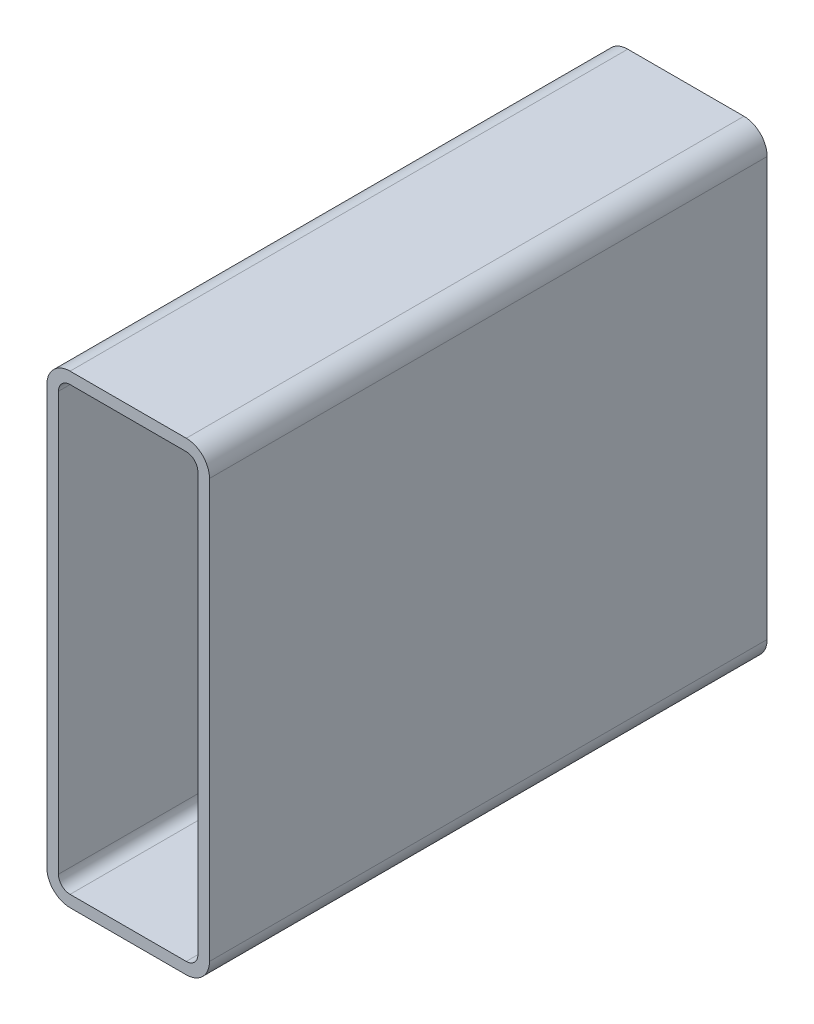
ISO-10303-21;
HEADER;
FILE_DESCRIPTION(('STEP AP214'),'2;1');
FILE_NAME('part.step','',(''),(''),'','','');
FILE_SCHEMA(('AUTOMOTIVE_DESIGN { 1 0 10303 214 1 1 1 1 }'));
ENDSEC;
DATA;
#1=APPLICATION_CONTEXT('core data for automotive mechanical design processes');
#2=APPLICATION_PROTOCOL_DEFINITION('international standard','automotive_design',2000,#1);
#3=PRODUCT_CONTEXT('',#1,'mechanical');
#4=PRODUCT('Part','Part','',(#3));
#5=PRODUCT_RELATED_PRODUCT_CATEGORY('part','',(#4));
#6=PRODUCT_DEFINITION_FORMATION('','',#4);
#7=PRODUCT_DEFINITION_CONTEXT('part definition',#1,'design');
#8=PRODUCT_DEFINITION('design','',#6,#7);
#9=PRODUCT_DEFINITION_SHAPE('','',#8);
#10=(LENGTH_UNIT() NAMED_UNIT(*) SI_UNIT(.MILLI.,.METRE.));
#11=(NAMED_UNIT(*) PLANE_ANGLE_UNIT() SI_UNIT($,.RADIAN.));
#12=(NAMED_UNIT(*) SI_UNIT($,.STERADIAN.) SOLID_ANGLE_UNIT());
#13=UNCERTAINTY_MEASURE_WITH_UNIT(LENGTH_MEASURE(1.E-05),#10,'distance_accuracy_value','');
#14=(GEOMETRIC_REPRESENTATION_CONTEXT(3) GLOBAL_UNCERTAINTY_ASSIGNED_CONTEXT((#13)) GLOBAL_UNIT_ASSIGNED_CONTEXT((#10,
#11,#12)) REPRESENTATION_CONTEXT('',''));
#15=CARTESIAN_POINT('',(0.,0.,0.));
#16=DIRECTION('',(0.,0.,1.));
#17=DIRECTION('',(1.,0.,0.));
#18=AXIS2_PLACEMENT_3D('',#15,#16,#17);
#19=CARTESIAN_POINT('',(14.7821469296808,243.220313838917,304.8));
#20=DIRECTION('',(0.,0.,1.));
#21=DIRECTION('',(1.,0.,0.));
#22=AXIS2_PLACEMENT_3D('',#19,#20,#21);
#23=PLANE('',#22);
#24=CARTESIAN_POINT('',(14.7821469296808,243.220313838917,304.8));
#25=DIRECTION('',(0.,0.,1.));
#26=DIRECTION('',(1.,0.,0.));
#27=AXIS2_PLACEMENT_3D('',#24,#25,#26);
#28=CIRCLE('',#27,12.7);
#29=CARTESIAN_POINT('',(14.7821469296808,255.920313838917,304.8));
#30=VERTEX_POINT('',#29);
#31=CARTESIAN_POINT('',(2.08214692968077,243.220313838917,304.8));
#32=VERTEX_POINT('',#31);
#33=EDGE_CURVE('E211',#30,#32,#28,.T.);
#34=ORIENTED_EDGE('',*,*,#33,.T.);
#35=DIRECTION('',(0.,-1.,0.));
#36=VECTOR('',#35,1.);
#37=CARTESIAN_POINT('',(2.08214692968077,14.6203138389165,304.8));
#38=LINE('',#37,#36);
#39=CARTESIAN_POINT('',(2.08214692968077,14.6203138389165,304.8));
#40=VERTEX_POINT('',#39);
#41=EDGE_CURVE('E214',#32,#40,#38,.T.);
#42=ORIENTED_EDGE('',*,*,#41,.T.);
#43=CARTESIAN_POINT('',(14.7821469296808,14.6203138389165,304.8));
#44=DIRECTION('',(0.,0.,1.));
#45=DIRECTION('',(1.,0.,0.));
#46=AXIS2_PLACEMENT_3D('',#43,#44,#45);
#47=CIRCLE('',#46,12.7);
#48=CARTESIAN_POINT('',(14.7821469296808,1.92031383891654,304.8));
#49=VERTEX_POINT('',#48);
#50=EDGE_CURVE('E217',#40,#49,#47,.T.);
#51=ORIENTED_EDGE('',*,*,#50,.T.);
#52=DIRECTION('',(1.,0.,0.));
#53=VECTOR('',#52,1.);
#54=CARTESIAN_POINT('',(78.2821469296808,1.92031383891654,304.8));
#55=LINE('',#54,#53);
#56=CARTESIAN_POINT('',(78.2821469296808,1.92031383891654,304.8));
#57=VERTEX_POINT('',#56);
#58=EDGE_CURVE('E219',#49,#57,#55,.T.);
#59=ORIENTED_EDGE('',*,*,#58,.T.);
#60=CARTESIAN_POINT('',(78.2821469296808,14.6203138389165,304.8));
#61=DIRECTION('',(0.,0.,1.));
#62=DIRECTION('',(1.,0.,0.));
#63=AXIS2_PLACEMENT_3D('',#60,#61,#62);
#64=CIRCLE('',#63,12.7);
#65=CARTESIAN_POINT('',(90.9821469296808,14.6203138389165,304.8));
#66=VERTEX_POINT('',#65);
#67=EDGE_CURVE('E221',#57,#66,#64,.T.);
#68=ORIENTED_EDGE('',*,*,#67,.T.);
#69=DIRECTION('',(0.,1.,0.));
#70=VECTOR('',#69,1.);
#71=CARTESIAN_POINT('',(90.9821469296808,243.220313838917,304.8));
#72=LINE('',#71,#70);
#73=CARTESIAN_POINT('',(90.9821469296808,243.220313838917,304.8));
#74=VERTEX_POINT('',#73);
#75=EDGE_CURVE('E223',#66,#74,#72,.T.);
#76=ORIENTED_EDGE('',*,*,#75,.T.);
#77=CARTESIAN_POINT('',(78.2821469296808,243.220313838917,304.8));
#78=DIRECTION('',(0.,0.,1.));
#79=DIRECTION('',(1.,0.,0.));
#80=AXIS2_PLACEMENT_3D('',#77,#78,#79);
#81=CIRCLE('',#80,12.7);
#82=CARTESIAN_POINT('',(78.2821469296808,255.920313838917,304.8));
#83=VERTEX_POINT('',#82);
#84=EDGE_CURVE('E225',#74,#83,#81,.T.);
#85=ORIENTED_EDGE('',*,*,#84,.T.);
#86=DIRECTION('',(-1.,0.,0.));
#87=VECTOR('',#86,1.);
#88=CARTESIAN_POINT('',(14.7821469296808,255.920313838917,304.8));
#89=LINE('',#88,#87);
#90=EDGE_CURVE('E227',#83,#30,#89,.T.);
#91=ORIENTED_EDGE('',*,*,#90,.T.);
#92=EDGE_LOOP('',(#34,#42,#51,#59,#68,#76,#85,#91));
#93=FACE_BOUND('',#92,.T.);
#94=DIRECTION('',(0.,-1.,0.));
#95=VECTOR('',#94,1.);
#96=CARTESIAN_POINT('',(8.43214692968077,14.6203138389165,304.8));
#97=LINE('',#96,#95);
#98=CARTESIAN_POINT('',(8.43214692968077,243.220313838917,304.8));
#99=VERTEX_POINT('',#98);
#100=CARTESIAN_POINT('',(8.43214692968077,14.6203138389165,304.8));
#101=VERTEX_POINT('',#100);
#102=EDGE_CURVE('E154',#99,#101,#97,.T.);
#103=ORIENTED_EDGE('',*,*,#102,.F.);
#104=CARTESIAN_POINT('',(14.7821469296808,243.220313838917,304.8));
#105=DIRECTION('',(0.,0.,1.));
#106=DIRECTION('',(1.,0.,0.));
#107=AXIS2_PLACEMENT_3D('',#104,#105,#106);
#108=CIRCLE('',#107,6.35000000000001);
#109=CARTESIAN_POINT('',(14.7821469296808,249.570313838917,304.8));
#110=VERTEX_POINT('',#109);
#111=EDGE_CURVE('E146',#110,#99,#108,.T.);
#112=ORIENTED_EDGE('',*,*,#111,.F.);
#113=DIRECTION('',(-1.,0.,0.));
#114=VECTOR('',#113,1.);
#115=CARTESIAN_POINT('',(14.7821469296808,249.570313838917,304.8));
#116=LINE('',#115,#114);
#117=CARTESIAN_POINT('',(78.2821469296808,249.570313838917,304.8));
#118=VERTEX_POINT('',#117);
#119=EDGE_CURVE('E179',#118,#110,#116,.T.);
#120=ORIENTED_EDGE('',*,*,#119,.F.);
#121=CARTESIAN_POINT('',(78.2821469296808,243.220313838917,304.8));
#122=DIRECTION('',(0.,0.,1.));
#123=DIRECTION('',(1.,0.,0.));
#124=AXIS2_PLACEMENT_3D('',#121,#122,#123);
#125=CIRCLE('',#124,6.35000000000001);
#126=CARTESIAN_POINT('',(84.6321469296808,243.220313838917,304.8));
#127=VERTEX_POINT('',#126);
#128=EDGE_CURVE('E177',#127,#118,#125,.T.);
#129=ORIENTED_EDGE('',*,*,#128,.F.);
#130=DIRECTION('',(0.,1.,0.));
#131=VECTOR('',#130,1.);
#132=CARTESIAN_POINT('',(84.6321469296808,243.220313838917,304.8));
#133=LINE('',#132,#131);
#134=CARTESIAN_POINT('',(84.6321469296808,14.6203138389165,304.8));
#135=VERTEX_POINT('',#134);
#136=EDGE_CURVE('E175',#135,#127,#133,.T.);
#137=ORIENTED_EDGE('',*,*,#136,.F.);
#138=CARTESIAN_POINT('',(78.2821469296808,14.6203138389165,304.8));
#139=DIRECTION('',(0.,0.,1.));
#140=DIRECTION('',(1.,0.,0.));
#141=AXIS2_PLACEMENT_3D('',#138,#139,#140);
#142=CIRCLE('',#141,6.35);
#143=CARTESIAN_POINT('',(78.2821469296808,8.27031383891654,304.8));
#144=VERTEX_POINT('',#143);
#145=EDGE_CURVE('E173',#144,#135,#142,.T.);
#146=ORIENTED_EDGE('',*,*,#145,.F.);
#147=DIRECTION('',(1.,0.,0.));
#148=VECTOR('',#147,1.);
#149=CARTESIAN_POINT('',(78.2821469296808,8.27031383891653,304.8));
#150=LINE('',#149,#148);
#151=CARTESIAN_POINT('',(14.7821469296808,8.27031383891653,304.8));
#152=VERTEX_POINT('',#151);
#153=EDGE_CURVE('E169',#152,#144,#150,.T.);
#154=ORIENTED_EDGE('',*,*,#153,.F.);
#155=CARTESIAN_POINT('',(14.7821469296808,14.6203138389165,304.8));
#156=DIRECTION('',(0.,0.,1.));
#157=DIRECTION('',(1.,0.,0.));
#158=AXIS2_PLACEMENT_3D('',#155,#156,#157);
#159=CIRCLE('',#158,6.35);
#160=EDGE_CURVE('E167',#101,#152,#159,.T.);
#161=ORIENTED_EDGE('',*,*,#160,.F.);
#162=EDGE_LOOP('',(#103,#112,#120,#129,#137,#146,#154,#161));
#163=FACE_BOUND('',#162,.T.);
#164=ADVANCED_FACE('F33',(#93,#163),#23,.T.);
#165=CARTESIAN_POINT('',(14.7821469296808,243.220313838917,0.));
#166=DIRECTION('',(0.,0.,1.));
#167=DIRECTION('',(1.,0.,0.));
#168=AXIS2_PLACEMENT_3D('',#165,#166,#167);
#169=PLANE('',#168);
#170=CARTESIAN_POINT('',(14.7821469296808,243.220313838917,0.));
#171=DIRECTION('',(0.,0.,1.));
#172=DIRECTION('',(1.,0.,0.));
#173=AXIS2_PLACEMENT_3D('',#170,#171,#172);
#174=CIRCLE('',#173,12.7);
#175=CARTESIAN_POINT('',(14.7821469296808,255.920313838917,0.));
#176=VERTEX_POINT('',#175);
#177=CARTESIAN_POINT('',(2.08214692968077,243.220313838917,0.));
#178=VERTEX_POINT('',#177);
#179=EDGE_CURVE('E162',#176,#178,#174,.T.);
#180=ORIENTED_EDGE('',*,*,#179,.F.);
#181=DIRECTION('',(-1.,0.,0.));
#182=VECTOR('',#181,1.);
#183=CARTESIAN_POINT('',(14.7821469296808,255.920313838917,0.));
#184=LINE('',#183,#182);
#185=CARTESIAN_POINT('',(78.2821469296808,255.920313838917,0.));
#186=VERTEX_POINT('',#185);
#187=EDGE_CURVE('E215',#186,#176,#184,.T.);
#188=ORIENTED_EDGE('',*,*,#187,.F.);
#189=CARTESIAN_POINT('',(78.2821469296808,243.220313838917,0.));
#190=DIRECTION('',(0.,0.,1.));
#191=DIRECTION('',(1.,0.,0.));
#192=AXIS2_PLACEMENT_3D('',#189,#190,#191);
#193=CIRCLE('',#192,12.7);
#194=CARTESIAN_POINT('',(90.9821469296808,243.220313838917,0.));
#195=VERTEX_POINT('',#194);
#196=EDGE_CURVE('E242',#195,#186,#193,.T.);
#197=ORIENTED_EDGE('',*,*,#196,.F.);
#198=DIRECTION('',(0.,1.,0.));
#199=VECTOR('',#198,1.);
#200=CARTESIAN_POINT('',(90.9821469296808,243.220313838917,0.));
#201=LINE('',#200,#199);
#202=CARTESIAN_POINT('',(90.9821469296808,14.6203138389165,0.));
#203=VERTEX_POINT('',#202);
#204=EDGE_CURVE('E240',#203,#195,#201,.T.);
#205=ORIENTED_EDGE('',*,*,#204,.F.);
#206=CARTESIAN_POINT('',(78.2821469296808,14.6203138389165,0.));
#207=DIRECTION('',(0.,0.,1.));
#208=DIRECTION('',(1.,0.,0.));
#209=AXIS2_PLACEMENT_3D('',#206,#207,#208);
#210=CIRCLE('',#209,12.7);
#211=CARTESIAN_POINT('',(78.2821469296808,1.92031383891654,0.));
#212=VERTEX_POINT('',#211);
#213=EDGE_CURVE('E238',#212,#203,#210,.T.);
#214=ORIENTED_EDGE('',*,*,#213,.F.);
#215=DIRECTION('',(1.,0.,0.));
#216=VECTOR('',#215,1.);
#217=CARTESIAN_POINT('',(78.2821469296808,1.92031383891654,0.));
#218=LINE('',#217,#216);
#219=CARTESIAN_POINT('',(14.7821469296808,1.92031383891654,0.));
#220=VERTEX_POINT('',#219);
#221=EDGE_CURVE('E236',#220,#212,#218,.T.);
#222=ORIENTED_EDGE('',*,*,#221,.F.);
#223=CARTESIAN_POINT('',(14.7821469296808,14.6203138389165,0.));
#224=DIRECTION('',(0.,0.,1.));
#225=DIRECTION('',(1.,0.,0.));
#226=AXIS2_PLACEMENT_3D('',#223,#224,#225);
#227=CIRCLE('',#226,12.7);
#228=CARTESIAN_POINT('',(2.08214692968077,14.6203138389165,0.));
#229=VERTEX_POINT('',#228);
#230=EDGE_CURVE('E234',#229,#220,#227,.T.);
#231=ORIENTED_EDGE('',*,*,#230,.F.);
#232=DIRECTION('',(0.,-1.,0.));
#233=VECTOR('',#232,1.);
#234=CARTESIAN_POINT('',(2.08214692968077,14.6203138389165,0.));
#235=LINE('',#234,#233);
#236=EDGE_CURVE('E232',#178,#229,#235,.T.);
#237=ORIENTED_EDGE('',*,*,#236,.F.);
#238=EDGE_LOOP('',(#180,#188,#197,#205,#214,#222,#231,#237));
#239=FACE_BOUND('',#238,.T.);
#240=CARTESIAN_POINT('',(14.7821469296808,243.220313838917,0.));
#241=DIRECTION('',(0.,0.,1.));
#242=DIRECTION('',(1.,0.,0.));
#243=AXIS2_PLACEMENT_3D('',#240,#241,#242);
#244=CIRCLE('',#243,6.35000000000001);
#245=CARTESIAN_POINT('',(14.7821469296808,249.570313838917,0.));
#246=VERTEX_POINT('',#245);
#247=CARTESIAN_POINT('',(8.43214692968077,243.220313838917,0.));
#248=VERTEX_POINT('',#247);
#249=EDGE_CURVE('E56',#246,#248,#244,.T.);
#250=ORIENTED_EDGE('',*,*,#249,.T.);
#251=DIRECTION('',(0.,-1.,0.));
#252=VECTOR('',#251,1.);
#253=CARTESIAN_POINT('',(8.43214692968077,14.6203138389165,0.));
#254=LINE('',#253,#252);
#255=CARTESIAN_POINT('',(8.43214692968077,14.6203138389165,0.));
#256=VERTEX_POINT('',#255);
#257=EDGE_CURVE('E161',#248,#256,#254,.T.);
#258=ORIENTED_EDGE('',*,*,#257,.T.);
#259=CARTESIAN_POINT('',(14.7821469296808,14.6203138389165,0.));
#260=DIRECTION('',(0.,0.,1.));
#261=DIRECTION('',(1.,0.,0.));
#262=AXIS2_PLACEMENT_3D('',#259,#260,#261);
#263=CIRCLE('',#262,6.35);
#264=CARTESIAN_POINT('',(14.7821469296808,8.27031383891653,0.));
#265=VERTEX_POINT('',#264);
#266=EDGE_CURVE('E183',#256,#265,#263,.T.);
#267=ORIENTED_EDGE('',*,*,#266,.T.);
#268=DIRECTION('',(1.,0.,0.));
#269=VECTOR('',#268,1.);
#270=CARTESIAN_POINT('',(78.2821469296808,8.27031383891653,0.));
#271=LINE('',#270,#269);
#272=CARTESIAN_POINT('',(78.2821469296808,8.27031383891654,0.));
#273=VERTEX_POINT('',#272);
#274=EDGE_CURVE('E186',#265,#273,#271,.T.);
#275=ORIENTED_EDGE('',*,*,#274,.T.);
#276=CARTESIAN_POINT('',(78.2821469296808,14.6203138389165,0.));
#277=DIRECTION('',(0.,0.,1.));
#278=DIRECTION('',(1.,0.,0.));
#279=AXIS2_PLACEMENT_3D('',#276,#277,#278);
#280=CIRCLE('',#279,6.35);
#281=CARTESIAN_POINT('',(84.6321469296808,14.6203138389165,0.));
#282=VERTEX_POINT('',#281);
#283=EDGE_CURVE('E189',#273,#282,#280,.T.);
#284=ORIENTED_EDGE('',*,*,#283,.T.);
#285=DIRECTION('',(0.,1.,0.));
#286=VECTOR('',#285,1.);
#287=CARTESIAN_POINT('',(84.6321469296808,243.220313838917,0.));
#288=LINE('',#287,#286);
#289=CARTESIAN_POINT('',(84.6321469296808,243.220313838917,0.));
#290=VERTEX_POINT('',#289);
#291=EDGE_CURVE('E192',#282,#290,#288,.T.);
#292=ORIENTED_EDGE('',*,*,#291,.T.);
#293=CARTESIAN_POINT('',(78.2821469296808,243.220313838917,0.));
#294=DIRECTION('',(0.,0.,1.));
#295=DIRECTION('',(1.,0.,0.));
#296=AXIS2_PLACEMENT_3D('',#293,#294,#295);
#297=CIRCLE('',#296,6.35000000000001);
#298=CARTESIAN_POINT('',(78.2821469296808,249.570313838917,0.));
#299=VERTEX_POINT('',#298);
#300=EDGE_CURVE('E195',#290,#299,#297,.T.);
#301=ORIENTED_EDGE('',*,*,#300,.T.);
#302=DIRECTION('',(-1.,0.,0.));
#303=VECTOR('',#302,1.);
#304=CARTESIAN_POINT('',(14.7821469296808,249.570313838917,0.));
#305=LINE('',#304,#303);
#306=EDGE_CURVE('E155',#299,#246,#305,.T.);
#307=ORIENTED_EDGE('',*,*,#306,.T.);
#308=EDGE_LOOP('',(#250,#258,#267,#275,#284,#292,#301,#307));
#309=FACE_BOUND('',#308,.T.);
#310=ADVANCED_FACE('F272',(#239,#309),#169,.F.);
#311=CARTESIAN_POINT('',(14.7821469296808,243.220313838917,304.8));
#312=DIRECTION('',(0.,0.,-1.));
#313=DIRECTION('',(-1.,0.,0.));
#314=AXIS2_PLACEMENT_3D('',#311,#312,#313);
#315=CYLINDRICAL_SURFACE('',#314,12.7);
#316=ORIENTED_EDGE('',*,*,#179,.T.);
#317=DIRECTION('',(0.,0.,-1.));
#318=VECTOR('',#317,1.);
#319=CARTESIAN_POINT('',(2.08214692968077,243.220313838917,304.8));
#320=LINE('',#319,#318);
#321=EDGE_CURVE('E11',#32,#178,#320,.T.);
#322=ORIENTED_EDGE('',*,*,#321,.F.);
#323=ORIENTED_EDGE('',*,*,#33,.F.);
#324=DIRECTION('',(0.,0.,-1.));
#325=VECTOR('',#324,1.);
#326=CARTESIAN_POINT('',(14.7821469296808,255.920313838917,304.8));
#327=LINE('',#326,#325);
#328=EDGE_CURVE('E229',#30,#176,#327,.T.);
#329=ORIENTED_EDGE('',*,*,#328,.T.);
#330=EDGE_LOOP('',(#316,#322,#323,#329));
#331=FACE_BOUND('',#330,.T.);
#332=ADVANCED_FACE('F35',(#331),#315,.T.);
#333=CARTESIAN_POINT('',(2.08214692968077,14.6203138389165,304.8));
#334=DIRECTION('',(1.,0.,0.));
#335=DIRECTION('',(0.,0.,-1.));
#336=AXIS2_PLACEMENT_3D('',#333,#334,#335);
#337=PLANE('',#336);
#338=ORIENTED_EDGE('',*,*,#236,.T.);
#339=DIRECTION('',(0.,0.,-1.));
#340=VECTOR('',#339,1.);
#341=CARTESIAN_POINT('',(2.08214692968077,14.6203138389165,304.8));
#342=LINE('',#341,#340);
#343=EDGE_CURVE('E41',#40,#229,#342,.T.);
#344=ORIENTED_EDGE('',*,*,#343,.F.);
#345=ORIENTED_EDGE('',*,*,#41,.F.);
#346=ORIENTED_EDGE('',*,*,#321,.T.);
#347=EDGE_LOOP('',(#338,#344,#345,#346));
#348=FACE_BOUND('',#347,.T.);
#349=ADVANCED_FACE('F289',(#348),#337,.F.);
#350=CARTESIAN_POINT('',(14.7821469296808,14.6203138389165,304.8));
#351=DIRECTION('',(0.,0.,-1.));
#352=DIRECTION('',(-1.,0.,0.));
#353=AXIS2_PLACEMENT_3D('',#350,#351,#352);
#354=CYLINDRICAL_SURFACE('',#353,12.7);
#355=ORIENTED_EDGE('',*,*,#230,.T.);
#356=DIRECTION('',(0.,0.,-1.));
#357=VECTOR('',#356,1.);
#358=CARTESIAN_POINT('',(14.7821469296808,1.92031383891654,304.8));
#359=LINE('',#358,#357);
#360=EDGE_CURVE('E259',#49,#220,#359,.T.);
#361=ORIENTED_EDGE('',*,*,#360,.F.);
#362=ORIENTED_EDGE('',*,*,#50,.F.);
#363=ORIENTED_EDGE('',*,*,#343,.T.);
#364=EDGE_LOOP('',(#355,#361,#362,#363));
#365=FACE_BOUND('',#364,.T.);
#366=ADVANCED_FACE('F266',(#365),#354,.T.);
#367=CARTESIAN_POINT('',(78.2821469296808,1.92031383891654,304.8));
#368=DIRECTION('',(0.,1.,0.));
#369=DIRECTION('',(0.,0.,1.));
#370=AXIS2_PLACEMENT_3D('',#367,#368,#369);
#371=PLANE('',#370);
#372=ORIENTED_EDGE('',*,*,#221,.T.);
#373=DIRECTION('',(0.,0.,-1.));
#374=VECTOR('',#373,1.);
#375=CARTESIAN_POINT('',(78.2821469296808,1.92031383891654,304.8));
#376=LINE('',#375,#374);
#377=EDGE_CURVE('E256',#57,#212,#376,.T.);
#378=ORIENTED_EDGE('',*,*,#377,.F.);
#379=ORIENTED_EDGE('',*,*,#58,.F.);
#380=ORIENTED_EDGE('',*,*,#360,.T.);
#381=EDGE_LOOP('',(#372,#378,#379,#380));
#382=FACE_BOUND('',#381,.T.);
#383=ADVANCED_FACE('F278',(#382),#371,.F.);
#384=CARTESIAN_POINT('',(78.2821469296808,14.6203138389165,304.8));
#385=DIRECTION('',(0.,0.,-1.));
#386=DIRECTION('',(-1.,0.,0.));
#387=AXIS2_PLACEMENT_3D('',#384,#385,#386);
#388=CYLINDRICAL_SURFACE('',#387,12.7);
#389=ORIENTED_EDGE('',*,*,#213,.T.);
#390=DIRECTION('',(0.,0.,-1.));
#391=VECTOR('',#390,1.);
#392=CARTESIAN_POINT('',(90.9821469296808,14.6203138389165,304.8));
#393=LINE('',#392,#391);
#394=EDGE_CURVE('E253',#66,#203,#393,.T.);
#395=ORIENTED_EDGE('',*,*,#394,.F.);
#396=ORIENTED_EDGE('',*,*,#67,.F.);
#397=ORIENTED_EDGE('',*,*,#377,.T.);
#398=EDGE_LOOP('',(#389,#395,#396,#397));
#399=FACE_BOUND('',#398,.T.);
#400=ADVANCED_FACE('F282',(#399),#388,.T.);
#401=CARTESIAN_POINT('',(90.9821469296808,243.220313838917,304.8));
#402=DIRECTION('',(-1.,0.,0.));
#403=DIRECTION('',(0.,0.,1.));
#404=AXIS2_PLACEMENT_3D('',#401,#402,#403);
#405=PLANE('',#404);
#406=ORIENTED_EDGE('',*,*,#204,.T.);
#407=DIRECTION('',(0.,0.,-1.));
#408=VECTOR('',#407,1.);
#409=CARTESIAN_POINT('',(90.9821469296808,243.220313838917,304.8));
#410=LINE('',#409,#408);
#411=EDGE_CURVE('E250',#74,#195,#410,.T.);
#412=ORIENTED_EDGE('',*,*,#411,.F.);
#413=ORIENTED_EDGE('',*,*,#75,.F.);
#414=ORIENTED_EDGE('',*,*,#394,.T.);
#415=EDGE_LOOP('',(#406,#412,#413,#414));
#416=FACE_BOUND('',#415,.T.);
#417=ADVANCED_FACE('F302',(#416),#405,.F.);
#418=CARTESIAN_POINT('',(78.2821469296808,243.220313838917,304.8));
#419=DIRECTION('',(0.,0.,-1.));
#420=DIRECTION('',(-1.,0.,0.));
#421=AXIS2_PLACEMENT_3D('',#418,#419,#420);
#422=CYLINDRICAL_SURFACE('',#421,12.7);
#423=ORIENTED_EDGE('',*,*,#196,.T.);
#424=DIRECTION('',(0.,0.,-1.));
#425=VECTOR('',#424,1.);
#426=CARTESIAN_POINT('',(78.2821469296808,255.920313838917,304.8));
#427=LINE('',#426,#425);
#428=EDGE_CURVE('E247',#83,#186,#427,.T.);
#429=ORIENTED_EDGE('',*,*,#428,.F.);
#430=ORIENTED_EDGE('',*,*,#84,.F.);
#431=ORIENTED_EDGE('',*,*,#411,.T.);
#432=EDGE_LOOP('',(#423,#429,#430,#431));
#433=FACE_BOUND('',#432,.T.);
#434=ADVANCED_FACE('F300',(#433),#422,.T.);
#435=CARTESIAN_POINT('',(14.7821469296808,255.920313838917,304.8));
#436=DIRECTION('',(0.,-1.,0.));
#437=DIRECTION('',(0.,0.,-1.));
#438=AXIS2_PLACEMENT_3D('',#435,#436,#437);
#439=PLANE('',#438);
#440=ORIENTED_EDGE('',*,*,#187,.T.);
#441=ORIENTED_EDGE('',*,*,#328,.F.);
#442=ORIENTED_EDGE('',*,*,#90,.F.);
#443=ORIENTED_EDGE('',*,*,#428,.T.);
#444=EDGE_LOOP('',(#440,#441,#442,#443));
#445=FACE_BOUND('',#444,.T.);
#446=ADVANCED_FACE('F295',(#445),#439,.F.);
#447=CARTESIAN_POINT('',(14.7821469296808,243.220313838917,304.8));
#448=DIRECTION('',(0.,0.,-1.));
#449=DIRECTION('',(-1.,0.,0.));
#450=AXIS2_PLACEMENT_3D('',#447,#448,#449);
#451=CYLINDRICAL_SURFACE('',#450,6.35000000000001);
#452=ORIENTED_EDGE('',*,*,#249,.F.);
#453=DIRECTION('',(0.,0.,-1.));
#454=VECTOR('',#453,1.);
#455=CARTESIAN_POINT('',(14.7821469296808,249.570313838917,304.8));
#456=LINE('',#455,#454);
#457=EDGE_CURVE('E150',#110,#246,#456,.T.);
#458=ORIENTED_EDGE('',*,*,#457,.F.);
#459=ORIENTED_EDGE('',*,*,#111,.T.);
#460=DIRECTION('',(0.,0.,-1.));
#461=VECTOR('',#460,1.);
#462=CARTESIAN_POINT('',(8.43214692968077,243.220313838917,304.8));
#463=LINE('',#462,#461);
#464=EDGE_CURVE('E149',#99,#248,#463,.T.);
#465=ORIENTED_EDGE('',*,*,#464,.T.);
#466=EDGE_LOOP('',(#452,#458,#459,#465));
#467=FACE_BOUND('',#466,.T.);
#468=ADVANCED_FACE('F148',(#467),#451,.F.);
#469=CARTESIAN_POINT('',(8.43214692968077,14.6203138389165,304.8));
#470=DIRECTION('',(1.,0.,0.));
#471=DIRECTION('',(0.,0.,-1.));
#472=AXIS2_PLACEMENT_3D('',#469,#470,#471);
#473=PLANE('',#472);
#474=ORIENTED_EDGE('',*,*,#257,.F.);
#475=ORIENTED_EDGE('',*,*,#464,.F.);
#476=ORIENTED_EDGE('',*,*,#102,.T.);
#477=DIRECTION('',(0.,0.,-1.));
#478=VECTOR('',#477,1.);
#479=CARTESIAN_POINT('',(8.43214692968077,14.6203138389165,304.8));
#480=LINE('',#479,#478);
#481=EDGE_CURVE('E163',#101,#256,#480,.T.);
#482=ORIENTED_EDGE('',*,*,#481,.T.);
#483=EDGE_LOOP('',(#474,#475,#476,#482));
#484=FACE_BOUND('',#483,.T.);
#485=ADVANCED_FACE('F158',(#484),#473,.T.);
#486=CARTESIAN_POINT('',(14.7821469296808,14.6203138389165,304.8));
#487=DIRECTION('',(0.,0.,-1.));
#488=DIRECTION('',(-1.,0.,0.));
#489=AXIS2_PLACEMENT_3D('',#486,#487,#488);
#490=CYLINDRICAL_SURFACE('',#489,6.35);
#491=ORIENTED_EDGE('',*,*,#266,.F.);
#492=ORIENTED_EDGE('',*,*,#481,.F.);
#493=ORIENTED_EDGE('',*,*,#160,.T.);
#494=DIRECTION('',(0.,0.,-1.));
#495=VECTOR('',#494,1.);
#496=CARTESIAN_POINT('',(14.7821469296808,8.27031383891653,304.8));
#497=LINE('',#496,#495);
#498=EDGE_CURVE('E208',#152,#265,#497,.T.);
#499=ORIENTED_EDGE('',*,*,#498,.T.);
#500=EDGE_LOOP('',(#491,#492,#493,#499));
#501=FACE_BOUND('',#500,.T.);
#502=ADVANCED_FACE('F327',(#501),#490,.F.);
#503=CARTESIAN_POINT('',(78.2821469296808,8.27031383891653,304.8));
#504=DIRECTION('',(0.,1.,0.));
#505=DIRECTION('',(0.,0.,1.));
#506=AXIS2_PLACEMENT_3D('',#503,#504,#505);
#507=PLANE('',#506);
#508=ORIENTED_EDGE('',*,*,#274,.F.);
#509=ORIENTED_EDGE('',*,*,#498,.F.);
#510=ORIENTED_EDGE('',*,*,#153,.T.);
#511=DIRECTION('',(0.,0.,-1.));
#512=VECTOR('',#511,1.);
#513=CARTESIAN_POINT('',(78.2821469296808,8.27031383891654,304.8));
#514=LINE('',#513,#512);
#515=EDGE_CURVE('E206',#144,#273,#514,.T.);
#516=ORIENTED_EDGE('',*,*,#515,.T.);
#517=EDGE_LOOP('',(#508,#509,#510,#516));
#518=FACE_BOUND('',#517,.T.);
#519=ADVANCED_FACE('F331',(#518),#507,.T.);
#520=CARTESIAN_POINT('',(78.2821469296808,14.6203138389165,304.8));
#521=DIRECTION('',(0.,0.,-1.));
#522=DIRECTION('',(-1.,0.,0.));
#523=AXIS2_PLACEMENT_3D('',#520,#521,#522);
#524=CYLINDRICAL_SURFACE('',#523,6.35);
#525=ORIENTED_EDGE('',*,*,#283,.F.);
#526=ORIENTED_EDGE('',*,*,#515,.F.);
#527=ORIENTED_EDGE('',*,*,#145,.T.);
#528=DIRECTION('',(0.,0.,-1.));
#529=VECTOR('',#528,1.);
#530=CARTESIAN_POINT('',(84.6321469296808,14.6203138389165,304.8));
#531=LINE('',#530,#529);
#532=EDGE_CURVE('E204',#135,#282,#531,.T.);
#533=ORIENTED_EDGE('',*,*,#532,.T.);
#534=EDGE_LOOP('',(#525,#526,#527,#533));
#535=FACE_BOUND('',#534,.T.);
#536=ADVANCED_FACE('F337',(#535),#524,.F.);
#537=CARTESIAN_POINT('',(84.6321469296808,243.220313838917,304.8));
#538=DIRECTION('',(-1.,0.,0.));
#539=DIRECTION('',(0.,0.,1.));
#540=AXIS2_PLACEMENT_3D('',#537,#538,#539);
#541=PLANE('',#540);
#542=ORIENTED_EDGE('',*,*,#291,.F.);
#543=ORIENTED_EDGE('',*,*,#532,.F.);
#544=ORIENTED_EDGE('',*,*,#136,.T.);
#545=DIRECTION('',(0.,0.,-1.));
#546=VECTOR('',#545,1.);
#547=CARTESIAN_POINT('',(84.6321469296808,243.220313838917,304.8));
#548=LINE('',#547,#546);
#549=EDGE_CURVE('E202',#127,#290,#548,.T.);
#550=ORIENTED_EDGE('',*,*,#549,.T.);
#551=EDGE_LOOP('',(#542,#543,#544,#550));
#552=FACE_BOUND('',#551,.T.);
#553=ADVANCED_FACE('F341',(#552),#541,.T.);
#554=CARTESIAN_POINT('',(78.2821469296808,243.220313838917,304.8));
#555=DIRECTION('',(0.,0.,-1.));
#556=DIRECTION('',(-1.,0.,0.));
#557=AXIS2_PLACEMENT_3D('',#554,#555,#556);
#558=CYLINDRICAL_SURFACE('',#557,6.35000000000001);
#559=ORIENTED_EDGE('',*,*,#300,.F.);
#560=ORIENTED_EDGE('',*,*,#549,.F.);
#561=ORIENTED_EDGE('',*,*,#128,.T.);
#562=DIRECTION('',(0.,0.,-1.));
#563=VECTOR('',#562,1.);
#564=CARTESIAN_POINT('',(78.2821469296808,249.570313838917,304.8));
#565=LINE('',#564,#563);
#566=EDGE_CURVE('E48',#118,#299,#565,.T.);
#567=ORIENTED_EDGE('',*,*,#566,.T.);
#568=EDGE_LOOP('',(#559,#560,#561,#567));
#569=FACE_BOUND('',#568,.T.);
#570=ADVANCED_FACE('F345',(#569),#558,.F.);
#571=CARTESIAN_POINT('',(14.7821469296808,249.570313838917,304.8));
#572=DIRECTION('',(0.,-1.,0.));
#573=DIRECTION('',(0.,0.,-1.));
#574=AXIS2_PLACEMENT_3D('',#571,#572,#573);
#575=PLANE('',#574);
#576=ORIENTED_EDGE('',*,*,#306,.F.);
#577=ORIENTED_EDGE('',*,*,#566,.F.);
#578=ORIENTED_EDGE('',*,*,#119,.T.);
#579=ORIENTED_EDGE('',*,*,#457,.T.);
#580=EDGE_LOOP('',(#576,#577,#578,#579));
#581=FACE_BOUND('',#580,.T.);
#582=ADVANCED_FACE('F349',(#581),#575,.T.);
#583=CLOSED_SHELL('',(#164,#310,#332,#349,#366,#383,#400,#417,#434,#446,#468,#485,#502,#519,
#536,#553,#570,#582));
#584=MANIFOLD_SOLID_BREP('B2',#583);
#585=ADVANCED_BREP_SHAPE_REPRESENTATION('',(#18,#584),#14);
#586=SHAPE_DEFINITION_REPRESENTATION(#9,#585);
ENDSEC;
END-ISO-10303-21;
